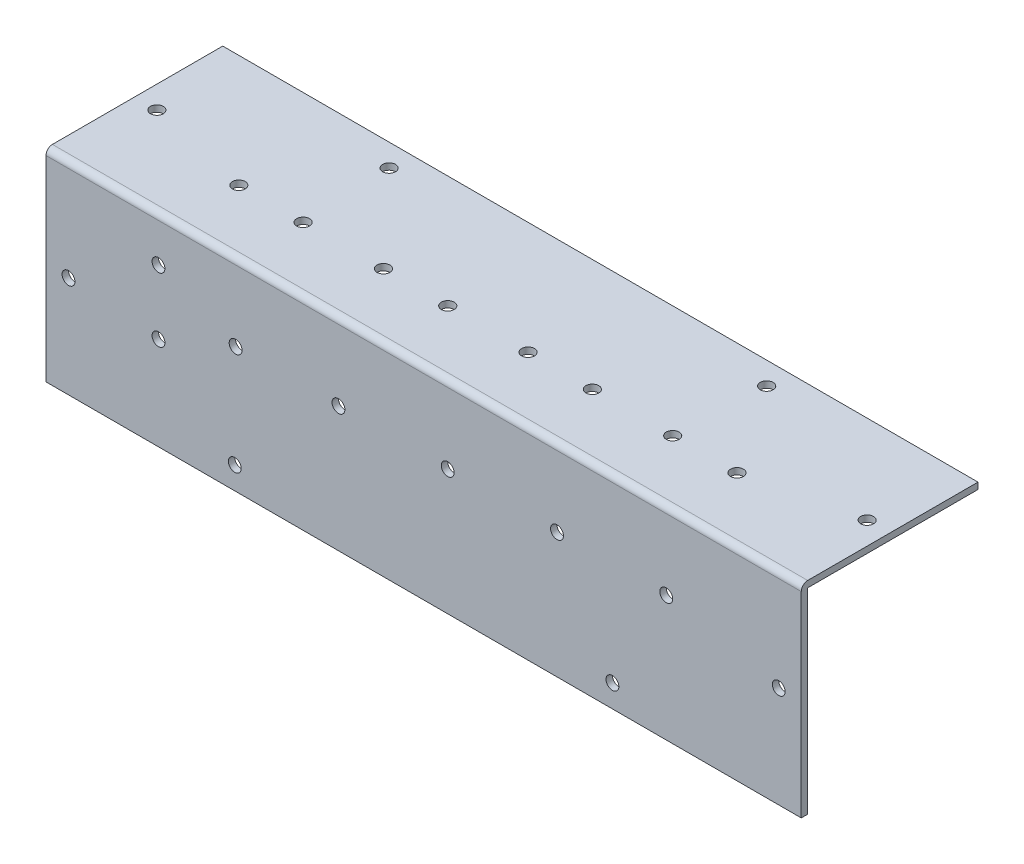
from build123d import *

# Parameters (mm, degrees)
ESQUISSE1_W             = 235
ESQUISSE1_H             = 61
BOSS_EXTRU_1_DEPTH      = 2
ESQUISSE2_W             = 235
ESQUISSE2_H             = 2
BOSS_EXTRU_2_DEPTH      = 55
ENL_V_MAT_EXTRU_1_REACH = 251.437
ESQUISSE4_R             = 2
ESQUISSE5_R             = 2
ENL_V_MAT_EXTRU_2_DEPTH = 40
ESQUISSE6_R             = 2
ENL_V_MAT_EXTRU_3_DEPTH = 40
CONG_1_R                = 2


with BuildPart() as part:
    # Esquisse1 → Boss.-Extru.1 (new body)
    with BuildSketch(Plane.XY):
        with Locations((117.5, 30.5)):
            Rectangle(ESQUISSE1_W, ESQUISSE1_H)
    extrude(amount=BOSS_EXTRU_1_DEPTH)

    # Esquisse2 → Boss.-Extru.2 (add)
    with BuildSketch(Plane.XY.offset(2)):
        with Locations((117.5, 62)):
            Rectangle(ESQUISSE2_W, ESQUISSE2_H)
    extrude(amount=-BOSS_EXTRU_2_DEPTH)

    # Esquisse4 → Enl_v. mat.-Extru.1 (cut, up to next)
    with BuildSketch(Plane.XY.offset(2), mode=Mode.PRIVATE) as enl_v_mat_extru_1_sk1:
        with Locations((7, 31.5)):
            Circle(ESQUISSE4_R)
    enl_v_mat_extru_1_tool1 = extrude(enl_v_mat_extru_1_sk1.sketch, amount=-ENL_V_MAT_EXTRU_1_REACH, mode=Mode.PRIVATE) & part.part
    # Esquisse4 → Enl_v. mat.-Extru.1 (cut, up to next)
    with BuildSketch(Plane.XY.offset(2), mode=Mode.PRIVATE) as enl_v_mat_extru_1_sk2:
        with Locations((228, 31.5)):
            Circle(ESQUISSE4_R)
    enl_v_mat_extru_1_tool2 = extrude(enl_v_mat_extru_1_sk2.sketch, amount=-ENL_V_MAT_EXTRU_1_REACH, mode=Mode.PRIVATE) & part.part
    # Esquisse4 → Enl_v. mat.-Extru.1 (cut, up to next)
    with BuildSketch(Plane.XY.offset(2), mode=Mode.PRIVATE) as enl_v_mat_extru_1_sk3:
        with Locations((176.25, 7)):
            Circle(ESQUISSE4_R)
    enl_v_mat_extru_1_tool3 = extrude(enl_v_mat_extru_1_sk3.sketch, amount=-ENL_V_MAT_EXTRU_1_REACH, mode=Mode.PRIVATE) & part.part
    # Esquisse4 → Enl_v. mat.-Extru.1 (cut, up to next)
    with BuildSketch(Plane.XY.offset(2), mode=Mode.PRIVATE) as enl_v_mat_extru_1_sk4:
        with Locations((58.75, 7)):
            Circle(ESQUISSE4_R)
    enl_v_mat_extru_1_tool4 = extrude(enl_v_mat_extru_1_sk4.sketch, amount=-ENL_V_MAT_EXTRU_1_REACH, mode=Mode.PRIVATE) & part.part
    # Esquisse4 → Enl_v. mat.-Extru.1 (cut, up to next)
    with BuildSketch(Plane.XY.offset(2), mode=Mode.PRIVATE) as enl_v_mat_extru_1_sk5:
        with Locations((59, 39)):
            Circle(ESQUISSE4_R)
    enl_v_mat_extru_1_tool5 = extrude(enl_v_mat_extru_1_sk5.sketch, amount=-ENL_V_MAT_EXTRU_1_REACH, mode=Mode.PRIVATE) & part.part
    # Esquisse4 → Enl_v. mat.-Extru.1 (cut, up to next)
    with BuildSketch(Plane.XY.offset(2), mode=Mode.PRIVATE) as enl_v_mat_extru_1_sk6:
        with Locations((91, 39)):
            Circle(ESQUISSE4_R)
    enl_v_mat_extru_1_tool6 = extrude(enl_v_mat_extru_1_sk6.sketch, amount=-ENL_V_MAT_EXTRU_1_REACH, mode=Mode.PRIVATE) & part.part
    # Esquisse4 → Enl_v. mat.-Extru.1 (cut, up to next)
    with BuildSketch(Plane.XY.offset(2), mode=Mode.PRIVATE) as enl_v_mat_extru_1_sk7:
        with Locations((125, 39)):
            Circle(ESQUISSE4_R)
    enl_v_mat_extru_1_tool7 = extrude(enl_v_mat_extru_1_sk7.sketch, amount=-ENL_V_MAT_EXTRU_1_REACH, mode=Mode.PRIVATE) & part.part
    # Esquisse4 → Enl_v. mat.-Extru.1 (cut, up to next)
    with BuildSketch(Plane.XY.offset(2), mode=Mode.PRIVATE) as enl_v_mat_extru_1_sk8:
        with Locations((159, 39)):
            Circle(ESQUISSE4_R)
    enl_v_mat_extru_1_tool8 = extrude(enl_v_mat_extru_1_sk8.sketch, amount=-ENL_V_MAT_EXTRU_1_REACH, mode=Mode.PRIVATE) & part.part
    # Esquisse4 → Enl_v. mat.-Extru.1 (cut, up to next)
    with BuildSketch(Plane.XY.offset(2), mode=Mode.PRIVATE) as enl_v_mat_extru_1_sk9:
        with Locations((193, 39)):
            Circle(ESQUISSE4_R)
    enl_v_mat_extru_1_tool9 = extrude(enl_v_mat_extru_1_sk9.sketch, amount=-ENL_V_MAT_EXTRU_1_REACH, mode=Mode.PRIVATE) & part.part
    # Esquisse4 → Enl_v. mat.-Extru.1 (cut, up to next)
    with BuildSketch(Plane.XY.offset(2), mode=Mode.PRIVATE) as enl_v_mat_extru_1_sk10:
        with Locations((35, 49)):
            Circle(ESQUISSE4_R)
    enl_v_mat_extru_1_tool10 = extrude(enl_v_mat_extru_1_sk10.sketch, amount=-ENL_V_MAT_EXTRU_1_REACH, mode=Mode.PRIVATE) & part.part
    # Esquisse4 → Enl_v. mat.-Extru.1 (cut, up to next)
    with BuildSketch(Plane.XY.offset(2), mode=Mode.PRIVATE) as enl_v_mat_extru_1_sk11:
        with Locations((35, 29)):
            Circle(ESQUISSE4_R)
    enl_v_mat_extru_1_tool11 = extrude(enl_v_mat_extru_1_sk11.sketch, amount=-ENL_V_MAT_EXTRU_1_REACH, mode=Mode.PRIVATE) & part.part
    add(enl_v_mat_extru_1_tool1.solids().sort_by_distance((7, 31.5, 2))[0], mode=Mode.SUBTRACT)
    add(enl_v_mat_extru_1_tool2.solids().sort_by_distance((228, 31.5, 2))[0], mode=Mode.SUBTRACT)
    add(enl_v_mat_extru_1_tool3.solids().sort_by_distance((176.25, 7, 2))[0], mode=Mode.SUBTRACT)
    add(enl_v_mat_extru_1_tool4.solids().sort_by_distance((58.75, 7, 2))[0], mode=Mode.SUBTRACT)
    add(enl_v_mat_extru_1_tool5.solids().sort_by_distance((59, 39, 2))[0], mode=Mode.SUBTRACT)
    add(enl_v_mat_extru_1_tool6.solids().sort_by_distance((91, 39, 2))[0], mode=Mode.SUBTRACT)
    add(enl_v_mat_extru_1_tool7.solids().sort_by_distance((125, 39, 2))[0], mode=Mode.SUBTRACT)
    add(enl_v_mat_extru_1_tool8.solids().sort_by_distance((159, 39, 2))[0], mode=Mode.SUBTRACT)
    add(enl_v_mat_extru_1_tool9.solids().sort_by_distance((193, 39, 2))[0], mode=Mode.SUBTRACT)
    add(enl_v_mat_extru_1_tool10.solids().sort_by_distance((35, 49, 2))[0], mode=Mode.SUBTRACT)
    add(enl_v_mat_extru_1_tool11.solids().sort_by_distance((35, 29, 2))[0], mode=Mode.SUBTRACT)

    # Esquisse5 → Enl_v. mat.-Extru.2 (cut)
    with BuildSketch(Plane(origin=(0, 63, 0), x_dir=(1, 0, 0), z_dir=(0, 1, 0))):
        with Locations(Location((40, 18, 0), (0, 0, 270))):
            Circle(ESQUISSE5_R)
        with Locations(Location((60, 18, 0), (0, 0, 270))):
            Circle(ESQUISSE5_R)
        with Locations(Location((85, 18, 0), (0, 0, 270))):
            Circle(ESQUISSE5_R)
        with Locations(Location((105, 18, 0), (0, 0, 270))):
            Circle(ESQUISSE5_R)
        with Locations(Location((130, 18, 0), (0, 0, 270))):
            Circle(ESQUISSE5_R)
        with Locations(Location((150, 18, 0), (0, 0, 270))):
            Circle(ESQUISSE5_R)
        with Locations(Location((175, 18, 0), (0, 0, 270))):
            Circle(ESQUISSE5_R)
        with Locations(Location((195, 18, 0), (0, 0, 270))):
            Circle(ESQUISSE5_R)
    extrude(amount=-ENL_V_MAT_EXTRU_2_DEPTH, mode=Mode.SUBTRACT)

    # Esquisse6 → Enl_v. mat.-Extru.3 (cut)
    with BuildSketch(Plane(origin=(0, 63, 0), x_dir=(1, 0, 0), z_dir=(0, 1, 0))):
        with Locations(Location((228, 25.5, 0), (0, 0, 270))):
            Circle(ESQUISSE6_R)
        with Locations(Location((176.25, 46, 0), (0, 0, 270))):
            Circle(ESQUISSE6_R)
        with Locations(Location((58.75, 46, 0), (0, 0, 270))):
            Circle(ESQUISSE6_R)
        with Locations(Location((7, 25.5, 0), (0, 0, 270))):
            Circle(ESQUISSE6_R)
    extrude(amount=-ENL_V_MAT_EXTRU_3_DEPTH, mode=Mode.SUBTRACT)

    # Cong_1
    cong_1_edges = [part.edges().sort_by_distance(p)[0] for p in [
        (117.5, 63, 2),
    ]]
    fillet(cong_1_edges, radius=CONG_1_R)


solid = part.part
